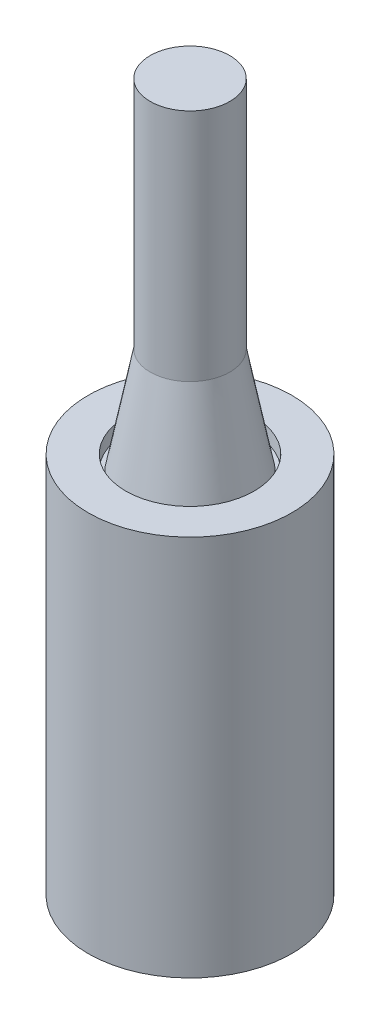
ISO-10303-21;
HEADER;
FILE_DESCRIPTION(('STEP AP214'),'2;1');
FILE_NAME('part.step','',(''),(''),'','','');
FILE_SCHEMA(('AUTOMOTIVE_DESIGN { 1 0 10303 214 1 1 1 1 }'));
ENDSEC;
DATA;
#1=APPLICATION_CONTEXT('core data for automotive mechanical design processes');
#2=APPLICATION_PROTOCOL_DEFINITION('international standard','automotive_design',2000,#1);
#3=PRODUCT_CONTEXT('',#1,'mechanical');
#4=PRODUCT('Part','Part','',(#3));
#5=PRODUCT_RELATED_PRODUCT_CATEGORY('part','',(#4));
#6=PRODUCT_DEFINITION_FORMATION('','',#4);
#7=PRODUCT_DEFINITION_CONTEXT('part definition',#1,'design');
#8=PRODUCT_DEFINITION('design','',#6,#7);
#9=PRODUCT_DEFINITION_SHAPE('','',#8);
#10=(LENGTH_UNIT() NAMED_UNIT(*) SI_UNIT(.MILLI.,.METRE.));
#11=(NAMED_UNIT(*) PLANE_ANGLE_UNIT() SI_UNIT($,.RADIAN.));
#12=(NAMED_UNIT(*) SI_UNIT($,.STERADIAN.) SOLID_ANGLE_UNIT());
#13=UNCERTAINTY_MEASURE_WITH_UNIT(LENGTH_MEASURE(1.E-05),#10,'distance_accuracy_value','');
#14=(GEOMETRIC_REPRESENTATION_CONTEXT(3) GLOBAL_UNCERTAINTY_ASSIGNED_CONTEXT((#13)) GLOBAL_UNIT_ASSIGNED_CONTEXT((#10,
#11,#12)) REPRESENTATION_CONTEXT('',''));
#15=CARTESIAN_POINT('',(0.,0.,0.));
#16=DIRECTION('',(0.,0.,1.));
#17=DIRECTION('',(1.,0.,0.));
#18=AXIS2_PLACEMENT_3D('',#15,#16,#17);
#19=CARTESIAN_POINT('',(0.,0.,0.));
#20=DIRECTION('',(0.,1.,0.));
#21=DIRECTION('',(0.,0.,1.));
#22=AXIS2_PLACEMENT_3D('',#19,#20,#21);
#23=PLANE('',#22);
#24=CARTESIAN_POINT('',(-3.81,0.,0.));
#25=DIRECTION('',(0.,1.,0.));
#26=DIRECTION('',(0.,0.,1.));
#27=AXIS2_PLACEMENT_3D('',#24,#25,#26);
#28=CIRCLE('',#27,2.3114);
#29=CARTESIAN_POINT('',(-3.81,0.,2.3114));
#30=VERTEX_POINT('',#29);
#31=EDGE_CURVE('E39',#30,#30,#28,.F.);
#32=ORIENTED_EDGE('',*,*,#31,.F.);
#33=EDGE_LOOP('',(#32));
#34=FACE_BOUND('',#33,.T.);
#35=CARTESIAN_POINT('',(0.,0.,0.));
#36=DIRECTION('',(0.,1.,0.));
#37=DIRECTION('',(0.,0.,1.));
#38=AXIS2_PLACEMENT_3D('',#35,#36,#37);
#39=CIRCLE('',#38,7.75);
#40=CARTESIAN_POINT('',(0.,0.,7.75));
#41=VERTEX_POINT('',#40);
#42=EDGE_CURVE('E50',#41,#41,#39,.T.);
#43=ORIENTED_EDGE('',*,*,#42,.F.);
#44=EDGE_LOOP('',(#43));
#45=FACE_BOUND('',#44,.T.);
#46=CARTESIAN_POINT('',(3.81,0.,0.));
#47=DIRECTION('',(0.,1.,0.));
#48=DIRECTION('',(0.,0.,1.));
#49=AXIS2_PLACEMENT_3D('',#46,#47,#48);
#50=CIRCLE('',#49,2.3114);
#51=CARTESIAN_POINT('',(3.81,0.,2.3114));
#52=VERTEX_POINT('',#51);
#53=EDGE_CURVE('E43',#52,#52,#50,.F.);
#54=ORIENTED_EDGE('',*,*,#53,.F.);
#55=EDGE_LOOP('',(#54));
#56=FACE_BOUND('',#55,.T.);
#57=CARTESIAN_POINT('',(0.,0.,3.8481));
#58=DIRECTION('',(0.,1.,0.));
#59=DIRECTION('',(0.,0.,1.));
#60=AXIS2_PLACEMENT_3D('',#57,#58,#59);
#61=CIRCLE('',#60,1.5875);
#62=CARTESIAN_POINT('',(0.,0.,5.4356));
#63=VERTEX_POINT('',#62);
#64=EDGE_CURVE('E10',#63,#63,#61,.F.);
#65=ORIENTED_EDGE('',*,*,#64,.F.);
#66=EDGE_LOOP('',(#65));
#67=FACE_BOUND('',#66,.T.);
#68=ADVANCED_FACE('F32',(#34,#45,#56,#67),#23,.F.);
#69=CARTESIAN_POINT('',(3.81,-6.35,0.));
#70=DIRECTION('',(0.,-1.,0.));
#71=DIRECTION('',(0.,0.,-1.));
#72=AXIS2_PLACEMENT_3D('',#69,#70,#71);
#73=PLANE('',#72);
#74=CARTESIAN_POINT('',(3.81,-6.35,0.));
#75=DIRECTION('',(0.,-1.,0.));
#76=DIRECTION('',(0.,0.,-1.));
#77=AXIS2_PLACEMENT_3D('',#74,#75,#76);
#78=CIRCLE('',#77,2.3114);
#79=CARTESIAN_POINT('',(3.81,-6.35,-2.3114));
#80=VERTEX_POINT('',#79);
#81=EDGE_CURVE('E64',#80,#80,#78,.T.);
#82=ORIENTED_EDGE('',*,*,#81,.T.);
#83=EDGE_LOOP('',(#82));
#84=FACE_BOUND('',#83,.T.);
#85=CARTESIAN_POINT('',(3.81,-6.35,0.));
#86=DIRECTION('',(0.,-1.,0.));
#87=DIRECTION('',(0.,0.,-1.));
#88=AXIS2_PLACEMENT_3D('',#85,#86,#87);
#89=CIRCLE('',#88,1.3716);
#90=CARTESIAN_POINT('',(3.81,-6.35,-1.3716));
#91=VERTEX_POINT('',#90);
#92=EDGE_CURVE('E77',#91,#91,#89,.T.);
#93=ORIENTED_EDGE('',*,*,#92,.F.);
#94=EDGE_LOOP('',(#93));
#95=FACE_BOUND('',#94,.T.);
#96=ADVANCED_FACE('F146',(#84,#95),#73,.T.);
#97=CARTESIAN_POINT('',(-3.81,-6.35,0.));
#98=DIRECTION('',(0.,-1.,0.));
#99=DIRECTION('',(0.,0.,-1.));
#100=AXIS2_PLACEMENT_3D('',#97,#98,#99);
#101=PLANE('',#100);
#102=CARTESIAN_POINT('',(-3.81,-6.35,0.));
#103=DIRECTION('',(0.,-1.,0.));
#104=DIRECTION('',(0.,0.,-1.));
#105=AXIS2_PLACEMENT_3D('',#102,#103,#104);
#106=CIRCLE('',#105,2.3114);
#107=CARTESIAN_POINT('',(-3.81,-6.35,-2.3114));
#108=VERTEX_POINT('',#107);
#109=EDGE_CURVE('E67',#108,#108,#106,.T.);
#110=ORIENTED_EDGE('',*,*,#109,.T.);
#111=EDGE_LOOP('',(#110));
#112=FACE_BOUND('',#111,.T.);
#113=CARTESIAN_POINT('',(-3.81,-6.35,0.));
#114=DIRECTION('',(0.,-1.,0.));
#115=DIRECTION('',(0.,0.,-1.));
#116=AXIS2_PLACEMENT_3D('',#113,#114,#115);
#117=CIRCLE('',#116,1.3716);
#118=CARTESIAN_POINT('',(-3.81,-6.35,-1.3716));
#119=VERTEX_POINT('',#118);
#120=EDGE_CURVE('E71',#119,#119,#117,.T.);
#121=ORIENTED_EDGE('',*,*,#120,.F.);
#122=EDGE_LOOP('',(#121));
#123=FACE_BOUND('',#122,.T.);
#124=ADVANCED_FACE('F141',(#112,#123),#101,.T.);
#125=CARTESIAN_POINT('',(0.,18.923,0.));
#126=DIRECTION('',(0.,-1.,0.));
#127=DIRECTION('',(0.,0.,-1.));
#128=AXIS2_PLACEMENT_3D('',#125,#126,#127);
#129=CYLINDRICAL_SURFACE('',#128,7.75);
#130=CARTESIAN_POINT('',(0.,18.923,0.));
#131=DIRECTION('',(0.,1.,0.));
#132=DIRECTION('',(0.,0.,1.));
#133=AXIS2_PLACEMENT_3D('',#130,#131,#132);
#134=CIRCLE('',#133,7.75);
#135=CARTESIAN_POINT('',(0.,18.923,7.75));
#136=VERTEX_POINT('',#135);
#137=EDGE_CURVE('E47',#136,#136,#134,.T.);
#138=ORIENTED_EDGE('',*,*,#137,.F.);
#139=EDGE_LOOP('',(#138));
#140=FACE_BOUND('',#139,.T.);
#141=ORIENTED_EDGE('',*,*,#42,.T.);
#142=EDGE_LOOP('',(#141));
#143=FACE_BOUND('',#142,.T.);
#144=ADVANCED_FACE('F34',(#140,#143),#129,.T.);
#145=CARTESIAN_POINT('',(3.81,-6.35,0.));
#146=DIRECTION('',(0.,1.,0.));
#147=DIRECTION('',(0.,0.,1.));
#148=AXIS2_PLACEMENT_3D('',#145,#146,#147);
#149=CYLINDRICAL_SURFACE('',#148,2.3114);
#150=ORIENTED_EDGE('',*,*,#81,.F.);
#151=EDGE_LOOP('',(#150));
#152=FACE_BOUND('',#151,.T.);
#153=ORIENTED_EDGE('',*,*,#53,.T.);
#154=EDGE_LOOP('',(#153));
#155=FACE_BOUND('',#154,.T.);
#156=ADVANCED_FACE('F140',(#152,#155),#149,.T.);
#157=CARTESIAN_POINT('',(-3.81,-6.35,0.));
#158=DIRECTION('',(0.,1.,0.));
#159=DIRECTION('',(0.,0.,1.));
#160=AXIS2_PLACEMENT_3D('',#157,#158,#159);
#161=CYLINDRICAL_SURFACE('',#160,2.3114);
#162=ORIENTED_EDGE('',*,*,#109,.F.);
#163=EDGE_LOOP('',(#162));
#164=FACE_BOUND('',#163,.T.);
#165=ORIENTED_EDGE('',*,*,#31,.T.);
#166=EDGE_LOOP('',(#165));
#167=FACE_BOUND('',#166,.T.);
#168=ADVANCED_FACE('F152',(#164,#167),#161,.T.);
#169=CARTESIAN_POINT('',(-3.81,-12.7,0.));
#170=DIRECTION('',(0.,1.,0.));
#171=DIRECTION('',(0.,0.,1.));
#172=AXIS2_PLACEMENT_3D('',#169,#170,#171);
#173=CYLINDRICAL_SURFACE('',#172,1.3716);
#174=CARTESIAN_POINT('',(-3.81,-12.7,0.));
#175=DIRECTION('',(0.,-1.,0.));
#176=DIRECTION('',(0.,0.,-1.));
#177=AXIS2_PLACEMENT_3D('',#174,#175,#176);
#178=CIRCLE('',#177,1.3716);
#179=CARTESIAN_POINT('',(-3.81,-12.7,-1.3716));
#180=VERTEX_POINT('',#179);
#181=EDGE_CURVE('E70',#180,#180,#178,.T.);
#182=ORIENTED_EDGE('',*,*,#181,.F.);
#183=EDGE_LOOP('',(#182));
#184=FACE_BOUND('',#183,.T.);
#185=ORIENTED_EDGE('',*,*,#120,.T.);
#186=EDGE_LOOP('',(#185));
#187=FACE_BOUND('',#186,.T.);
#188=ADVANCED_FACE('F158',(#184,#187),#173,.T.);
#189=CARTESIAN_POINT('',(-3.81,-12.7,0.));
#190=DIRECTION('',(0.,-1.,0.));
#191=DIRECTION('',(0.,0.,-1.));
#192=AXIS2_PLACEMENT_3D('',#189,#190,#191);
#193=PLANE('',#192);
#194=ORIENTED_EDGE('',*,*,#181,.T.);
#195=EDGE_LOOP('',(#194));
#196=FACE_BOUND('',#195,.T.);
#197=ADVANCED_FACE('F202',(#196),#193,.T.);
#198=CARTESIAN_POINT('',(3.81,-12.7,0.));
#199=DIRECTION('',(0.,1.,0.));
#200=DIRECTION('',(0.,0.,1.));
#201=AXIS2_PLACEMENT_3D('',#198,#199,#200);
#202=CYLINDRICAL_SURFACE('',#201,1.3716);
#203=CARTESIAN_POINT('',(3.81,-12.7,0.));
#204=DIRECTION('',(0.,-1.,0.));
#205=DIRECTION('',(0.,0.,-1.));
#206=AXIS2_PLACEMENT_3D('',#203,#204,#205);
#207=CIRCLE('',#206,1.3716);
#208=CARTESIAN_POINT('',(3.81,-12.7,-1.3716));
#209=VERTEX_POINT('',#208);
#210=EDGE_CURVE('E74',#209,#209,#207,.T.);
#211=ORIENTED_EDGE('',*,*,#210,.F.);
#212=EDGE_LOOP('',(#211));
#213=FACE_BOUND('',#212,.T.);
#214=ORIENTED_EDGE('',*,*,#92,.T.);
#215=EDGE_LOOP('',(#214));
#216=FACE_BOUND('',#215,.T.);
#217=ADVANCED_FACE('F198',(#213,#216),#202,.T.);
#218=CARTESIAN_POINT('',(3.81,-12.7,0.));
#219=DIRECTION('',(0.,-1.,0.));
#220=DIRECTION('',(0.,0.,-1.));
#221=AXIS2_PLACEMENT_3D('',#218,#219,#220);
#222=PLANE('',#221);
#223=ORIENTED_EDGE('',*,*,#210,.T.);
#224=EDGE_LOOP('',(#223));
#225=FACE_BOUND('',#224,.T.);
#226=ADVANCED_FACE('F192',(#225),#222,.T.);
#227=CARTESIAN_POINT('',(0.,-17.1901280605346,3.8481));
#228=DIRECTION('',(0.,1.,0.));
#229=DIRECTION('',(0.,0.,1.));
#230=AXIS2_PLACEMENT_3D('',#227,#228,#229);
#231=CYLINDRICAL_SURFACE('',#230,1.5875);
#232=ORIENTED_EDGE('',*,*,#64,.T.);
#233=EDGE_LOOP('',(#232));
#234=FACE_BOUND('',#233,.T.);
#235=CARTESIAN_POINT('',(0.,-12.7,3.8481));
#236=DIRECTION('',(0.,-1.,0.));
#237=DIRECTION('',(0.,0.,-1.));
#238=AXIS2_PLACEMENT_3D('',#235,#236,#237);
#239=CIRCLE('',#238,1.5875);
#240=CARTESIAN_POINT('',(0.,-12.7,2.2606));
#241=VERTEX_POINT('',#240);
#242=EDGE_CURVE('E80',#241,#241,#239,.T.);
#243=ORIENTED_EDGE('',*,*,#242,.F.);
#244=EDGE_LOOP('',(#243));
#245=FACE_BOUND('',#244,.T.);
#246=ADVANCED_FACE('F189',(#234,#245),#231,.T.);
#247=CARTESIAN_POINT('',(-3.81,-12.7,0.));
#248=DIRECTION('',(0.,-1.,0.));
#249=DIRECTION('',(0.,0.,-1.));
#250=AXIS2_PLACEMENT_3D('',#247,#248,#249);
#251=PLANE('',#250);
#252=ORIENTED_EDGE('',*,*,#242,.T.);
#253=EDGE_LOOP('',(#252));
#254=FACE_BOUND('',#253,.T.);
#255=ADVANCED_FACE('F134',(#254),#251,.T.);
#256=CARTESIAN_POINT('',(6.985,18.923,0.));
#257=DIRECTION('',(0.,1.,0.));
#258=DIRECTION('',(0.,0.,1.));
#259=AXIS2_PLACEMENT_3D('',#256,#257,#258);
#260=PLANE('',#259);
#261=CARTESIAN_POINT('',(0.,18.923,0.));
#262=DIRECTION('',(0.,1.,0.));
#263=DIRECTION('',(0.,0.,1.));
#264=AXIS2_PLACEMENT_3D('',#261,#262,#263);
#265=CIRCLE('',#264,8.1534);
#266=CARTESIAN_POINT('',(0.,18.923,8.1534));
#267=VERTEX_POINT('',#266);
#268=EDGE_CURVE('E88',#267,#267,#265,.T.);
#269=ORIENTED_EDGE('',*,*,#268,.F.);
#270=EDGE_LOOP('',(#269));
#271=FACE_BOUND('',#270,.T.);
#272=ORIENTED_EDGE('',*,*,#137,.T.);
#273=EDGE_LOOP('',(#272));
#274=FACE_BOUND('',#273,.T.);
#275=ADVANCED_FACE('F131',(#271,#274),#260,.F.);
#276=CARTESIAN_POINT('',(0.,0.,0.));
#277=DIRECTION('',(0.,1.,0.));
#278=DIRECTION('',(0.,0.,1.));
#279=AXIS2_PLACEMENT_3D('',#276,#277,#278);
#280=CYLINDRICAL_SURFACE('',#279,6.985);
#281=CARTESIAN_POINT('',(0.,18.923,0.));
#282=DIRECTION('',(0.,1.,0.));
#283=DIRECTION('',(0.,0.,1.));
#284=AXIS2_PLACEMENT_3D('',#281,#282,#283);
#285=CIRCLE('',#284,6.985);
#286=CARTESIAN_POINT('',(0.,18.923,6.985));
#287=VERTEX_POINT('',#286);
#288=EDGE_CURVE('E85',#287,#287,#285,.T.);
#289=ORIENTED_EDGE('',*,*,#288,.F.);
#290=EDGE_LOOP('',(#289));
#291=FACE_BOUND('',#290,.T.);
#292=CARTESIAN_POINT('',(0.,20.4770592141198,0.));
#293=DIRECTION('',(0.,1.,0.));
#294=DIRECTION('',(0.,0.,1.));
#295=AXIS2_PLACEMENT_3D('',#292,#293,#294);
#296=CIRCLE('',#295,6.985);
#297=CARTESIAN_POINT('',(0.,20.4770592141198,6.985));
#298=VERTEX_POINT('',#297);
#299=EDGE_CURVE('E100',#298,#298,#296,.T.);
#300=ORIENTED_EDGE('',*,*,#299,.T.);
#301=EDGE_LOOP('',(#300));
#302=FACE_BOUND('',#301,.T.);
#303=ADVANCED_FACE('F104',(#291,#302),#280,.F.);
#304=CARTESIAN_POINT('',(0.,0.,0.));
#305=DIRECTION('',(0.,1.,0.));
#306=DIRECTION('',(0.,0.,1.));
#307=AXIS2_PLACEMENT_3D('',#304,#305,#306);
#308=CYLINDRICAL_SURFACE('',#307,8.1534);
#309=CARTESIAN_POINT('',(0.,-21.0519407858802,0.));
#310=DIRECTION('',(0.,1.,0.));
#311=DIRECTION('',(0.,0.,1.));
#312=AXIS2_PLACEMENT_3D('',#309,#310,#311);
#313=CIRCLE('',#312,8.15340000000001);
#314=CARTESIAN_POINT('',(0.,-21.0519407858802,8.15340000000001));
#315=VERTEX_POINT('',#314);
#316=EDGE_CURVE('E91',#315,#315,#313,.T.);
#317=ORIENTED_EDGE('',*,*,#316,.F.);
#318=EDGE_LOOP('',(#317));
#319=FACE_BOUND('',#318,.T.);
#320=ORIENTED_EDGE('',*,*,#268,.T.);
#321=EDGE_LOOP('',(#320));
#322=FACE_BOUND('',#321,.T.);
#323=ADVANCED_FACE('F122',(#319,#322),#308,.F.);
#324=CARTESIAN_POINT('',(8.15340000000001,-21.0519407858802,0.));
#325=DIRECTION('',(0.,1.,0.));
#326=DIRECTION('',(0.,0.,1.));
#327=AXIS2_PLACEMENT_3D('',#324,#325,#326);
#328=PLANE('',#327);
#329=CARTESIAN_POINT('',(0.,-21.0519407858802,0.));
#330=DIRECTION('',(0.,1.,0.));
#331=DIRECTION('',(0.,0.,1.));
#332=AXIS2_PLACEMENT_3D('',#329,#330,#331);
#333=CIRCLE('',#332,11.0744);
#334=CARTESIAN_POINT('',(0.,-21.0519407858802,11.0744));
#335=VERTEX_POINT('',#334);
#336=EDGE_CURVE('E94',#335,#335,#333,.T.);
#337=ORIENTED_EDGE('',*,*,#336,.F.);
#338=EDGE_LOOP('',(#337));
#339=FACE_BOUND('',#338,.T.);
#340=ORIENTED_EDGE('',*,*,#316,.T.);
#341=EDGE_LOOP('',(#340));
#342=FACE_BOUND('',#341,.T.);
#343=ADVANCED_FACE('F116',(#339,#342),#328,.F.);
#344=CARTESIAN_POINT('',(0.,0.,0.));
#345=DIRECTION('',(0.,1.,0.));
#346=DIRECTION('',(0.,0.,1.));
#347=AXIS2_PLACEMENT_3D('',#344,#345,#346);
#348=CYLINDRICAL_SURFACE('',#347,11.0744);
#349=CARTESIAN_POINT('',(0.,20.4770592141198,0.));
#350=DIRECTION('',(0.,1.,0.));
#351=DIRECTION('',(0.,0.,1.));
#352=AXIS2_PLACEMENT_3D('',#349,#350,#351);
#353=CIRCLE('',#352,11.0744);
#354=CARTESIAN_POINT('',(0.,20.4770592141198,11.0744));
#355=VERTEX_POINT('',#354);
#356=EDGE_CURVE('E97',#355,#355,#353,.T.);
#357=ORIENTED_EDGE('',*,*,#356,.F.);
#358=EDGE_LOOP('',(#357));
#359=FACE_BOUND('',#358,.T.);
#360=ORIENTED_EDGE('',*,*,#336,.T.);
#361=EDGE_LOOP('',(#360));
#362=FACE_BOUND('',#361,.T.);
#363=ADVANCED_FACE('F110',(#359,#362),#348,.T.);
#364=CARTESIAN_POINT('',(11.0744,20.4770592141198,0.));
#365=DIRECTION('',(0.,-1.,0.));
#366=DIRECTION('',(0.,0.,-1.));
#367=AXIS2_PLACEMENT_3D('',#364,#365,#366);
#368=PLANE('',#367);
#369=ORIENTED_EDGE('',*,*,#299,.F.);
#370=EDGE_LOOP('',(#369));
#371=FACE_BOUND('',#370,.T.);
#372=ORIENTED_EDGE('',*,*,#356,.T.);
#373=EDGE_LOOP('',(#372));
#374=FACE_BOUND('',#373,.T.);
#375=ADVANCED_FACE('F106',(#371,#374),#368,.F.);
#376=CARTESIAN_POINT('',(0.,55.853,0.));
#377=DIRECTION('',(0.,1.,0.));
#378=DIRECTION('',(0.,0.,1.));
#379=AXIS2_PLACEMENT_3D('',#376,#377,#378);
#380=PLANE('',#379);
#381=CARTESIAN_POINT('',(0.,55.853,0.));
#382=DIRECTION('',(0.,1.,0.));
#383=DIRECTION('',(0.,0.,1.));
#384=AXIS2_PLACEMENT_3D('',#381,#382,#383);
#385=CIRCLE('',#384,4.32823306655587);
#386=CARTESIAN_POINT('',(0.,55.853,4.32823306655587));
#387=VERTEX_POINT('',#386);
#388=EDGE_CURVE('E61',#387,#387,#385,.T.);
#389=ORIENTED_EDGE('',*,*,#388,.T.);
#390=EDGE_LOOP('',(#389));
#391=FACE_BOUND('',#390,.T.);
#392=ADVANCED_FACE('F109',(#391),#380,.T.);
#393=CARTESIAN_POINT('',(0.,55.853,0.));
#394=DIRECTION('',(0.,-1.,0.));
#395=DIRECTION('',(0.,0.,-1.));
#396=AXIS2_PLACEMENT_3D('',#393,#394,#395);
#397=CYLINDRICAL_SURFACE('',#396,4.32823306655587);
#398=ORIENTED_EDGE('',*,*,#388,.F.);
#399=EDGE_LOOP('',(#398));
#400=FACE_BOUND('',#399,.T.);
#401=CARTESIAN_POINT('',(0.,30.353,0.));
#402=DIRECTION('',(0.,1.,0.));
#403=DIRECTION('',(0.,0.,1.));
#404=AXIS2_PLACEMENT_3D('',#401,#402,#403);
#405=CIRCLE('',#404,4.32823306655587);
#406=CARTESIAN_POINT('',(0.,30.353,4.32823306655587));
#407=VERTEX_POINT('',#406);
#408=EDGE_CURVE('E53',#407,#407,#405,.T.);
#409=ORIENTED_EDGE('',*,*,#408,.T.);
#410=EDGE_LOOP('',(#409));
#411=FACE_BOUND('',#410,.T.);
#412=ADVANCED_FACE('F166',(#400,#411),#397,.T.);
#413=CARTESIAN_POINT('',(0.,18.923,0.));
#414=DIRECTION('',(0.,-1.,0.));
#415=DIRECTION('',(0.,0.,1.));
#416=AXIS2_PLACEMENT_3D('',#413,#414,#415);
#417=CONICAL_SURFACE('',#416,6.55,0.191986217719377);
#418=ORIENTED_EDGE('',*,*,#408,.F.);
#419=EDGE_LOOP('',(#418));
#420=FACE_BOUND('',#419,.T.);
#421=CARTESIAN_POINT('',(0.,18.923,0.));
#422=DIRECTION('',(0.,1.,0.));
#423=DIRECTION('',(0.,0.,1.));
#424=AXIS2_PLACEMENT_3D('',#421,#422,#423);
#425=CIRCLE('',#424,6.55);
#426=CARTESIAN_POINT('',(0.,18.923,6.55));
#427=VERTEX_POINT('',#426);
#428=EDGE_CURVE('E58',#427,#427,#425,.T.);
#429=ORIENTED_EDGE('',*,*,#428,.T.);
#430=EDGE_LOOP('',(#429));
#431=FACE_BOUND('',#430,.T.);
#432=ADVANCED_FACE('F170',(#420,#431),#417,.T.);
#433=CARTESIAN_POINT('',(0.,18.923,0.));
#434=DIRECTION('',(0.,1.,0.));
#435=DIRECTION('',(0.,0.,1.));
#436=AXIS2_PLACEMENT_3D('',#433,#434,#435);
#437=PLANE('',#436);
#438=ORIENTED_EDGE('',*,*,#428,.F.);
#439=EDGE_LOOP('',(#438));
#440=FACE_BOUND('',#439,.T.);
#441=ORIENTED_EDGE('',*,*,#288,.T.);
#442=EDGE_LOOP('',(#441));
#443=FACE_BOUND('',#442,.T.);
#444=ADVANCED_FACE('F174',(#440,#443),#437,.T.);
#445=CLOSED_SHELL('',(#68,#96,#124,#144,#156,#168,#188,#197,#217,#226,#246,#255,#275,#303,#323,
#343,#363,#375,#392,#412,#432,#444));
#446=MANIFOLD_SOLID_BREP('B2',#445);
#447=ADVANCED_BREP_SHAPE_REPRESENTATION('',(#18,#446),#14);
#448=SHAPE_DEFINITION_REPRESENTATION(#9,#447);
ENDSEC;
END-ISO-10303-21;
